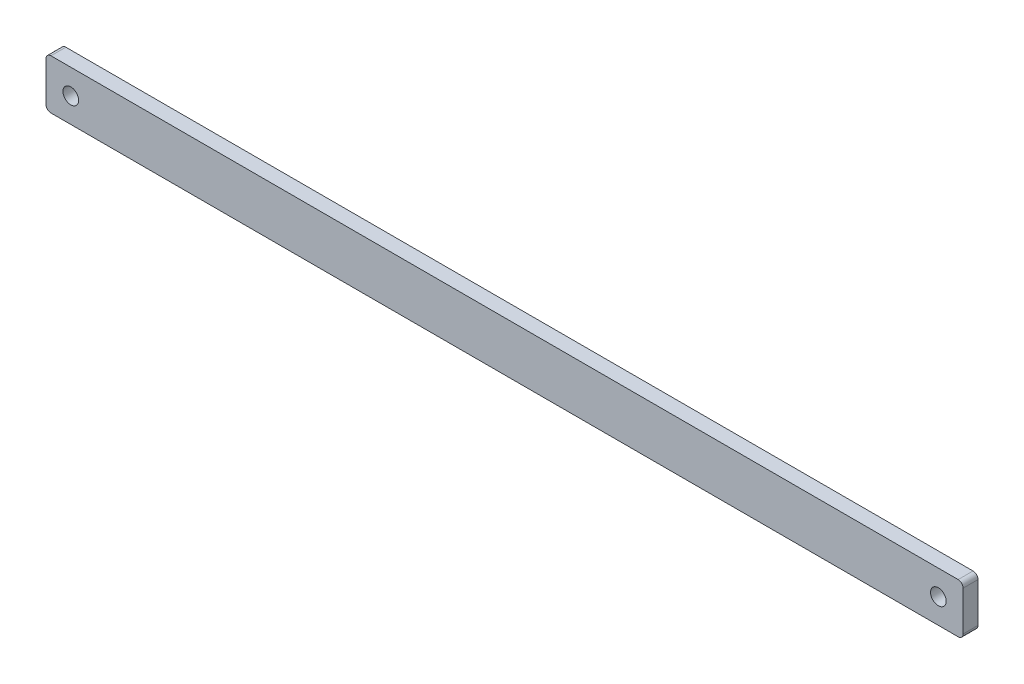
ISO-10303-21;
HEADER;
FILE_DESCRIPTION(('STEP AP214'),'2;1');
FILE_NAME('part.step','',(''),(''),'','','');
FILE_SCHEMA(('AUTOMOTIVE_DESIGN { 1 0 10303 214 1 1 1 1 }'));
ENDSEC;
DATA;
#1=APPLICATION_CONTEXT('core data for automotive mechanical design processes');
#2=APPLICATION_PROTOCOL_DEFINITION('international standard','automotive_design',2000,#1);
#3=PRODUCT_CONTEXT('',#1,'mechanical');
#4=PRODUCT('Part','Part','',(#3));
#5=PRODUCT_RELATED_PRODUCT_CATEGORY('part','',(#4));
#6=PRODUCT_DEFINITION_FORMATION('','',#4);
#7=PRODUCT_DEFINITION_CONTEXT('part definition',#1,'design');
#8=PRODUCT_DEFINITION('design','',#6,#7);
#9=PRODUCT_DEFINITION_SHAPE('','',#8);
#10=(LENGTH_UNIT() NAMED_UNIT(*) SI_UNIT(.MILLI.,.METRE.));
#11=(NAMED_UNIT(*) PLANE_ANGLE_UNIT() SI_UNIT($,.RADIAN.));
#12=(NAMED_UNIT(*) SI_UNIT($,.STERADIAN.) SOLID_ANGLE_UNIT());
#13=UNCERTAINTY_MEASURE_WITH_UNIT(LENGTH_MEASURE(1.E-05),#10,'distance_accuracy_value','');
#14=(GEOMETRIC_REPRESENTATION_CONTEXT(3) GLOBAL_UNCERTAINTY_ASSIGNED_CONTEXT((#13)) GLOBAL_UNIT_ASSIGNED_CONTEXT((#10,
#11,#12)) REPRESENTATION_CONTEXT('',''));
#15=CARTESIAN_POINT('',(0.,0.,0.));
#16=DIRECTION('',(0.,0.,1.));
#17=DIRECTION('',(1.,0.,0.));
#18=AXIS2_PLACEMENT_3D('',#15,#16,#17);
#19=CARTESIAN_POINT('',(0.,0.,7.62));
#20=DIRECTION('',(1.,0.,0.));
#21=DIRECTION('',(0.,0.,-1.));
#22=AXIS2_PLACEMENT_3D('',#19,#20,#21);
#23=PLANE('',#22);
#24=DIRECTION('',(0.,-1.,0.));
#25=VECTOR('',#24,1.);
#26=CARTESIAN_POINT('',(0.,0.,7.62));
#27=LINE('',#26,#25);
#28=CARTESIAN_POINT('',(0.,22.86,7.62));
#29=VERTEX_POINT('',#28);
#30=CARTESIAN_POINT('',(0.,2.54,7.62));
#31=VERTEX_POINT('',#30);
#32=EDGE_CURVE('E130',#29,#31,#27,.T.);
#33=ORIENTED_EDGE('',*,*,#32,.F.);
#34=DIRECTION('',(0.,0.,-1.));
#35=VECTOR('',#34,1.);
#36=CARTESIAN_POINT('',(0.,22.86,7.62));
#37=LINE('',#36,#35);
#38=CARTESIAN_POINT('',(0.,22.86,0.));
#39=VERTEX_POINT('',#38);
#40=EDGE_CURVE('E114',#29,#39,#37,.T.);
#41=ORIENTED_EDGE('',*,*,#40,.T.);
#42=DIRECTION('',(0.,-1.,0.));
#43=VECTOR('',#42,1.);
#44=CARTESIAN_POINT('',(0.,0.,0.));
#45=LINE('',#44,#43);
#46=CARTESIAN_POINT('',(0.,2.54,0.));
#47=VERTEX_POINT('',#46);
#48=EDGE_CURVE('E127',#39,#47,#45,.T.);
#49=ORIENTED_EDGE('',*,*,#48,.T.);
#50=DIRECTION('',(0.,0.,-1.));
#51=VECTOR('',#50,1.);
#52=CARTESIAN_POINT('',(0.,2.54,7.62));
#53=LINE('',#52,#51);
#54=EDGE_CURVE('E133',#47,#31,#53,.F.);
#55=ORIENTED_EDGE('',*,*,#54,.T.);
#56=EDGE_LOOP('',(#33,#41,#49,#55));
#57=FACE_BOUND('',#56,.T.);
#58=ADVANCED_FACE('F43',(#57),#23,.F.);
#59=CARTESIAN_POINT('',(0.,0.,7.62));
#60=DIRECTION('',(0.,1.,0.));
#61=DIRECTION('',(0.,0.,1.));
#62=AXIS2_PLACEMENT_3D('',#59,#60,#61);
#63=PLANE('',#62);
#64=DIRECTION('',(1.,0.,0.));
#65=VECTOR('',#64,1.);
#66=CARTESIAN_POINT('',(0.,0.,7.62));
#67=LINE('',#66,#65);
#68=CARTESIAN_POINT('',(2.54,0.,7.62));
#69=VERTEX_POINT('',#68);
#70=CARTESIAN_POINT('',(467.36,0.,7.62));
#71=VERTEX_POINT('',#70);
#72=EDGE_CURVE('E195',#69,#71,#67,.T.);
#73=ORIENTED_EDGE('',*,*,#72,.F.);
#74=DIRECTION('',(0.,0.,-1.));
#75=VECTOR('',#74,1.);
#76=CARTESIAN_POINT('',(2.54,0.,7.62));
#77=LINE('',#76,#75);
#78=CARTESIAN_POINT('',(2.54,0.,0.));
#79=VERTEX_POINT('',#78);
#80=EDGE_CURVE('E186',#69,#79,#77,.T.);
#81=ORIENTED_EDGE('',*,*,#80,.T.);
#82=DIRECTION('',(1.,0.,0.));
#83=VECTOR('',#82,1.);
#84=CARTESIAN_POINT('',(0.,0.,0.));
#85=LINE('',#84,#83);
#86=CARTESIAN_POINT('',(467.36,0.,0.));
#87=VERTEX_POINT('',#86);
#88=EDGE_CURVE('E138',#79,#87,#85,.T.);
#89=ORIENTED_EDGE('',*,*,#88,.T.);
#90=DIRECTION('',(0.,0.,-1.));
#91=VECTOR('',#90,1.);
#92=CARTESIAN_POINT('',(467.36,0.,7.62));
#93=LINE('',#92,#91);
#94=EDGE_CURVE('E183',#87,#71,#93,.F.);
#95=ORIENTED_EDGE('',*,*,#94,.T.);
#96=EDGE_LOOP('',(#73,#81,#89,#95));
#97=FACE_BOUND('',#96,.T.);
#98=ADVANCED_FACE('F245',(#97),#63,.F.);
#99=CARTESIAN_POINT('',(469.9,0.,7.62));
#100=DIRECTION('',(-1.,0.,0.));
#101=DIRECTION('',(0.,0.,1.));
#102=AXIS2_PLACEMENT_3D('',#99,#100,#101);
#103=PLANE('',#102);
#104=DIRECTION('',(0.,1.,0.));
#105=VECTOR('',#104,1.);
#106=CARTESIAN_POINT('',(469.9,0.,7.62));
#107=LINE('',#106,#105);
#108=CARTESIAN_POINT('',(469.9,2.54,7.62));
#109=VERTEX_POINT('',#108);
#110=CARTESIAN_POINT('',(469.9,22.86,7.62));
#111=VERTEX_POINT('',#110);
#112=EDGE_CURVE('E193',#109,#111,#107,.T.);
#113=ORIENTED_EDGE('',*,*,#112,.F.);
#114=DIRECTION('',(0.,0.,-1.));
#115=VECTOR('',#114,1.);
#116=CARTESIAN_POINT('',(469.9,2.54,7.62));
#117=LINE('',#116,#115);
#118=CARTESIAN_POINT('',(469.9,2.54,0.));
#119=VERTEX_POINT('',#118);
#120=EDGE_CURVE('E11',#109,#119,#117,.T.);
#121=ORIENTED_EDGE('',*,*,#120,.T.);
#122=DIRECTION('',(0.,1.,0.));
#123=VECTOR('',#122,1.);
#124=CARTESIAN_POINT('',(469.9,0.,0.));
#125=LINE('',#124,#123);
#126=CARTESIAN_POINT('',(469.9,22.86,0.));
#127=VERTEX_POINT('',#126);
#128=EDGE_CURVE('E144',#119,#127,#125,.T.);
#129=ORIENTED_EDGE('',*,*,#128,.T.);
#130=DIRECTION('',(0.,0.,-1.));
#131=VECTOR('',#130,1.);
#132=CARTESIAN_POINT('',(469.9,22.86,7.62));
#133=LINE('',#132,#131);
#134=EDGE_CURVE('E52',#127,#111,#133,.F.);
#135=ORIENTED_EDGE('',*,*,#134,.T.);
#136=EDGE_LOOP('',(#113,#121,#129,#135));
#137=FACE_BOUND('',#136,.T.);
#138=ADVANCED_FACE('F238',(#137),#103,.F.);
#139=CARTESIAN_POINT('',(0.,25.4,7.62));
#140=DIRECTION('',(0.,-1.,0.));
#141=DIRECTION('',(0.,0.,-1.));
#142=AXIS2_PLACEMENT_3D('',#139,#140,#141);
#143=PLANE('',#142);
#144=DIRECTION('',(-1.,0.,0.));
#145=VECTOR('',#144,1.);
#146=CARTESIAN_POINT('',(0.,25.4,0.));
#147=LINE('',#146,#145);
#148=CARTESIAN_POINT('',(467.36,25.4,0.));
#149=VERTEX_POINT('',#148);
#150=CARTESIAN_POINT('',(2.54,25.4,0.));
#151=VERTEX_POINT('',#150);
#152=EDGE_CURVE('E155',#149,#151,#147,.T.);
#153=ORIENTED_EDGE('',*,*,#152,.T.);
#154=DIRECTION('',(0.,0.,-1.));
#155=VECTOR('',#154,1.);
#156=CARTESIAN_POINT('',(2.54,25.4,7.62));
#157=LINE('',#156,#155);
#158=CARTESIAN_POINT('',(2.54,25.4,7.62));
#159=VERTEX_POINT('',#158);
#160=EDGE_CURVE('E115',#151,#159,#157,.F.);
#161=ORIENTED_EDGE('',*,*,#160,.T.);
#162=DIRECTION('',(-1.,0.,0.));
#163=VECTOR('',#162,1.);
#164=CARTESIAN_POINT('',(0.,25.4,7.62));
#165=LINE('',#164,#163);
#166=CARTESIAN_POINT('',(467.36,25.4,7.62));
#167=VERTEX_POINT('',#166);
#168=EDGE_CURVE('E150',#167,#159,#165,.T.);
#169=ORIENTED_EDGE('',*,*,#168,.F.);
#170=DIRECTION('',(0.,0.,-1.));
#171=VECTOR('',#170,1.);
#172=CARTESIAN_POINT('',(467.36,25.4,7.62));
#173=LINE('',#172,#171);
#174=EDGE_CURVE('E121',#167,#149,#173,.T.);
#175=ORIENTED_EDGE('',*,*,#174,.T.);
#176=EDGE_LOOP('',(#153,#161,#169,#175));
#177=FACE_BOUND('',#176,.T.);
#178=ADVANCED_FACE('F229',(#177),#143,.F.);
#179=CARTESIAN_POINT('',(0.,0.,7.62));
#180=DIRECTION('',(0.,0.,-1.));
#181=DIRECTION('',(-1.,0.,0.));
#182=AXIS2_PLACEMENT_3D('',#179,#180,#181);
#183=PLANE('',#182);
#184=CARTESIAN_POINT('',(457.2,12.6999999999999,7.62));
#185=DIRECTION('',(0.,0.,-1.));
#186=DIRECTION('',(-1.,0.,0.));
#187=AXIS2_PLACEMENT_3D('',#184,#185,#186);
#188=CIRCLE('',#187,4.);
#189=CARTESIAN_POINT('',(461.2,12.6999999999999,7.62));
#190=VERTEX_POINT('',#189);
#191=EDGE_CURVE('E205',#190,#190,#188,.T.);
#192=ORIENTED_EDGE('',*,*,#191,.T.);
#193=EDGE_LOOP('',(#192));
#194=FACE_BOUND('',#193,.T.);
#195=CARTESIAN_POINT('',(12.7,12.6999999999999,7.62));
#196=DIRECTION('',(0.,0.,1.));
#197=DIRECTION('',(1.,0.,0.));
#198=AXIS2_PLACEMENT_3D('',#195,#196,#197);
#199=CIRCLE('',#198,4.);
#200=CARTESIAN_POINT('',(16.7,12.6999999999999,7.62));
#201=VERTEX_POINT('',#200);
#202=EDGE_CURVE('E147',#201,#201,#199,.T.);
#203=ORIENTED_EDGE('',*,*,#202,.F.);
#204=EDGE_LOOP('',(#203));
#205=FACE_BOUND('',#204,.T.);
#206=ORIENTED_EDGE('',*,*,#168,.T.);
#207=CARTESIAN_POINT('',(2.54,22.86,7.62));
#208=DIRECTION('',(0.,0.,-1.));
#209=DIRECTION('',(-1.,0.,0.));
#210=AXIS2_PLACEMENT_3D('',#207,#208,#209);
#211=CIRCLE('',#210,2.54);
#212=EDGE_CURVE('E180',#159,#29,#211,.F.);
#213=ORIENTED_EDGE('',*,*,#212,.T.);
#214=ORIENTED_EDGE('',*,*,#32,.T.);
#215=CARTESIAN_POINT('',(2.54,2.54,7.62));
#216=DIRECTION('',(0.,0.,-1.));
#217=DIRECTION('',(-1.,0.,0.));
#218=AXIS2_PLACEMENT_3D('',#215,#216,#217);
#219=CIRCLE('',#218,2.54);
#220=EDGE_CURVE('E177',#31,#69,#219,.F.);
#221=ORIENTED_EDGE('',*,*,#220,.T.);
#222=ORIENTED_EDGE('',*,*,#72,.T.);
#223=CARTESIAN_POINT('',(467.36,2.54,7.62));
#224=DIRECTION('',(0.,0.,-1.));
#225=DIRECTION('',(-1.,0.,0.));
#226=AXIS2_PLACEMENT_3D('',#223,#224,#225);
#227=CIRCLE('',#226,2.54);
#228=EDGE_CURVE('E65',#71,#109,#227,.F.);
#229=ORIENTED_EDGE('',*,*,#228,.T.);
#230=ORIENTED_EDGE('',*,*,#112,.T.);
#231=CARTESIAN_POINT('',(467.36,22.86,7.62));
#232=DIRECTION('',(0.,0.,-1.));
#233=DIRECTION('',(-1.,0.,0.));
#234=AXIS2_PLACEMENT_3D('',#231,#232,#233);
#235=CIRCLE('',#234,2.54);
#236=EDGE_CURVE('E172',#111,#167,#235,.F.);
#237=ORIENTED_EDGE('',*,*,#236,.T.);
#238=EDGE_LOOP('',(#206,#213,#214,#221,#222,#229,#230,#237));
#239=FACE_BOUND('',#238,.T.);
#240=ADVANCED_FACE('F219',(#194,#205,#239),#183,.F.);
#241=CARTESIAN_POINT('',(0.,0.,0.));
#242=DIRECTION('',(0.,0.,-1.));
#243=DIRECTION('',(-1.,0.,0.));
#244=AXIS2_PLACEMENT_3D('',#241,#242,#243);
#245=PLANE('',#244);
#246=CARTESIAN_POINT('',(457.2,12.6999999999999,0.));
#247=DIRECTION('',(0.,0.,-1.));
#248=DIRECTION('',(-1.,0.,0.));
#249=AXIS2_PLACEMENT_3D('',#246,#247,#248);
#250=CIRCLE('',#249,4.);
#251=CARTESIAN_POINT('',(461.2,12.6999999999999,0.));
#252=VERTEX_POINT('',#251);
#253=EDGE_CURVE('E203',#252,#252,#250,.T.);
#254=ORIENTED_EDGE('',*,*,#253,.F.);
#255=EDGE_LOOP('',(#254));
#256=FACE_BOUND('',#255,.T.);
#257=CARTESIAN_POINT('',(12.7,12.6999999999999,0.));
#258=DIRECTION('',(0.,0.,1.));
#259=DIRECTION('',(1.,0.,0.));
#260=AXIS2_PLACEMENT_3D('',#257,#258,#259);
#261=CIRCLE('',#260,4.);
#262=CARTESIAN_POINT('',(16.7,12.6999999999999,0.));
#263=VERTEX_POINT('',#262);
#264=EDGE_CURVE('E139',#263,#263,#261,.T.);
#265=ORIENTED_EDGE('',*,*,#264,.T.);
#266=EDGE_LOOP('',(#265));
#267=FACE_BOUND('',#266,.T.);
#268=ORIENTED_EDGE('',*,*,#48,.F.);
#269=CARTESIAN_POINT('',(2.54,22.86,0.));
#270=DIRECTION('',(0.,0.,-1.));
#271=DIRECTION('',(-1.,0.,0.));
#272=AXIS2_PLACEMENT_3D('',#269,#270,#271);
#273=CIRCLE('',#272,2.54);
#274=EDGE_CURVE('E110',#39,#151,#273,.T.);
#275=ORIENTED_EDGE('',*,*,#274,.T.);
#276=ORIENTED_EDGE('',*,*,#152,.F.);
#277=CARTESIAN_POINT('',(467.36,22.86,0.));
#278=DIRECTION('',(0.,0.,-1.));
#279=DIRECTION('',(-1.,0.,0.));
#280=AXIS2_PLACEMENT_3D('',#277,#278,#279);
#281=CIRCLE('',#280,2.54);
#282=EDGE_CURVE('E132',#149,#127,#281,.T.);
#283=ORIENTED_EDGE('',*,*,#282,.T.);
#284=ORIENTED_EDGE('',*,*,#128,.F.);
#285=CARTESIAN_POINT('',(467.36,2.54,0.));
#286=DIRECTION('',(0.,0.,-1.));
#287=DIRECTION('',(-1.,0.,0.));
#288=AXIS2_PLACEMENT_3D('',#285,#286,#287);
#289=CIRCLE('',#288,2.54);
#290=EDGE_CURVE('E162',#119,#87,#289,.T.);
#291=ORIENTED_EDGE('',*,*,#290,.T.);
#292=ORIENTED_EDGE('',*,*,#88,.F.);
#293=CARTESIAN_POINT('',(2.54,2.54,0.));
#294=DIRECTION('',(0.,0.,-1.));
#295=DIRECTION('',(-1.,0.,0.));
#296=AXIS2_PLACEMENT_3D('',#293,#294,#295);
#297=CIRCLE('',#296,2.54);
#298=EDGE_CURVE('E122',#79,#47,#297,.T.);
#299=ORIENTED_EDGE('',*,*,#298,.T.);
#300=EDGE_LOOP('',(#268,#275,#276,#283,#284,#291,#292,#299));
#301=FACE_BOUND('',#300,.T.);
#302=ADVANCED_FACE('F135',(#256,#267,#301),#245,.T.);
#303=CARTESIAN_POINT('',(12.7,12.6999999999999,0.));
#304=DIRECTION('',(0.,0.,1.));
#305=DIRECTION('',(1.,0.,0.));
#306=AXIS2_PLACEMENT_3D('',#303,#304,#305);
#307=CYLINDRICAL_SURFACE('',#306,4.);
#308=CARTESIAN_POINT('',(16.7,12.6999999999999,0.));
#309=CARTESIAN_POINT('',(16.7,12.6999999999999,0.0793749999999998));
#310=CARTESIAN_POINT('',(16.7,12.6999999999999,0.15875));
#311=CARTESIAN_POINT('',(16.7,12.6999999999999,0.3175));
#312=CARTESIAN_POINT('',(16.7,12.6999999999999,0.396875));
#313=CARTESIAN_POINT('',(16.7,12.6999999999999,0.555625));
#314=CARTESIAN_POINT('',(16.7,12.6999999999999,0.635));
#315=CARTESIAN_POINT('',(16.7,12.6999999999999,0.79375));
#316=CARTESIAN_POINT('',(16.7,12.6999999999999,0.873125));
#317=CARTESIAN_POINT('',(16.7,12.6999999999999,1.031875));
#318=CARTESIAN_POINT('',(16.7,12.6999999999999,1.11125));
#319=CARTESIAN_POINT('',(16.7,12.6999999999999,1.27));
#320=CARTESIAN_POINT('',(16.7,12.6999999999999,1.349375));
#321=CARTESIAN_POINT('',(16.7,12.6999999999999,1.508125));
#322=CARTESIAN_POINT('',(16.7,12.6999999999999,1.5875));
#323=CARTESIAN_POINT('',(16.7,12.6999999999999,1.74625));
#324=CARTESIAN_POINT('',(16.7,12.6999999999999,1.825625));
#325=CARTESIAN_POINT('',(16.7,12.6999999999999,1.984375));
#326=CARTESIAN_POINT('',(16.7,12.6999999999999,2.06375));
#327=CARTESIAN_POINT('',(16.7,12.6999999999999,2.2225));
#328=CARTESIAN_POINT('',(16.7,12.6999999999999,2.301875));
#329=CARTESIAN_POINT('',(16.7,12.6999999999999,2.460625));
#330=CARTESIAN_POINT('',(16.7,12.6999999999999,2.54));
#331=CARTESIAN_POINT('',(16.7,12.6999999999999,2.69875));
#332=CARTESIAN_POINT('',(16.7,12.6999999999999,2.778125));
#333=CARTESIAN_POINT('',(16.7,12.6999999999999,2.936875));
#334=CARTESIAN_POINT('',(16.7,12.6999999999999,3.01625));
#335=CARTESIAN_POINT('',(16.7,12.6999999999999,3.175));
#336=CARTESIAN_POINT('',(16.7,12.6999999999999,3.254375));
#337=CARTESIAN_POINT('',(16.7,12.6999999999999,3.413125));
#338=CARTESIAN_POINT('',(16.7,12.6999999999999,3.4925));
#339=CARTESIAN_POINT('',(16.7,12.6999999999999,3.65125));
#340=CARTESIAN_POINT('',(16.7,12.6999999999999,3.730625));
#341=CARTESIAN_POINT('',(16.7,12.6999999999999,3.889375));
#342=CARTESIAN_POINT('',(16.7,12.6999999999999,3.96875));
#343=CARTESIAN_POINT('',(16.7,12.6999999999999,4.1275));
#344=CARTESIAN_POINT('',(16.7,12.6999999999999,4.206875));
#345=CARTESIAN_POINT('',(16.7,12.6999999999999,4.365625));
#346=CARTESIAN_POINT('',(16.7,12.6999999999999,4.445));
#347=CARTESIAN_POINT('',(16.7,12.6999999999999,4.60375));
#348=CARTESIAN_POINT('',(16.7,12.6999999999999,4.683125));
#349=CARTESIAN_POINT('',(16.7,12.6999999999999,4.841875));
#350=CARTESIAN_POINT('',(16.7,12.6999999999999,4.92125));
#351=CARTESIAN_POINT('',(16.7,12.6999999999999,5.08));
#352=CARTESIAN_POINT('',(16.7,12.6999999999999,5.159375));
#353=CARTESIAN_POINT('',(16.7,12.6999999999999,5.318125));
#354=CARTESIAN_POINT('',(16.7,12.6999999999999,5.3975));
#355=CARTESIAN_POINT('',(16.7,12.6999999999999,5.55625));
#356=CARTESIAN_POINT('',(16.7,12.6999999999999,5.635625));
#357=CARTESIAN_POINT('',(16.7,12.6999999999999,5.794375));
#358=CARTESIAN_POINT('',(16.7,12.6999999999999,5.87375));
#359=CARTESIAN_POINT('',(16.7,12.6999999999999,6.0325));
#360=CARTESIAN_POINT('',(16.7,12.6999999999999,6.111875));
#361=CARTESIAN_POINT('',(16.7,12.6999999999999,6.270625));
#362=CARTESIAN_POINT('',(16.7,12.6999999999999,6.35));
#363=CARTESIAN_POINT('',(16.7,12.6999999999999,6.50875));
#364=CARTESIAN_POINT('',(16.7,12.6999999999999,6.588125));
#365=CARTESIAN_POINT('',(16.7,12.6999999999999,6.746875));
#366=CARTESIAN_POINT('',(16.7,12.6999999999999,6.82625));
#367=CARTESIAN_POINT('',(16.7,12.6999999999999,6.985));
#368=CARTESIAN_POINT('',(16.7,12.6999999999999,7.064375));
#369=CARTESIAN_POINT('',(16.7,12.6999999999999,7.223125));
#370=CARTESIAN_POINT('',(16.7,12.6999999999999,7.3025));
#371=CARTESIAN_POINT('',(16.7,12.6999999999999,7.46125));
#372=CARTESIAN_POINT('',(16.7,12.6999999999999,7.540625));
#373=CARTESIAN_POINT('',(16.7,12.6999999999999,7.62));
#374=B_SPLINE_CURVE_WITH_KNOTS('',3,(#308,#309,#310,#311,#312,#313,#314,#315,#316,#317,#318,
#319,#320,#321,#322,#323,#324,#325,#326,#327,#328,#329,#330,#331,#332,#333,#334,#335,#336,#337,
#338,#339,#340,#341,#342,#343,#344,#345,#346,#347,#348,#349,#350,#351,#352,#353,#354,#355,#356,
#357,#358,#359,#360,#361,#362,#363,#364,#365,#366,#367,#368,#369,#370,#371,#372,#373),
.UNSPECIFIED.,.F.,.F.,(4,2,2,2,2,2,2,2,2,2,2,2,2,2,2,2,2,2,2,2,2,2,2,2,2,2,2,2,2,2,2,2,4),(0.,
0.238125,0.47625,0.714375,0.9525,1.190625,1.42875,1.666875,1.905,2.143125,2.38125,2.619375,
2.8575,3.095625,3.33375,3.571875,3.81,4.048125,4.28625,4.524375,4.7625,5.000625,5.23875,
5.476875,5.715,5.953125,6.19125,6.429375,6.6675,6.905625,7.14375,7.381875,7.62),.UNSPECIFIED.);
#375=EDGE_CURVE('BSEAM218',#263,#201,#374,.T.);
#376=ORIENTED_EDGE('',*,*,#264,.F.);
#377=ORIENTED_EDGE('',*,*,#202,.T.);
#378=ORIENTED_EDGE('',*,*,#375,.T.);
#379=ORIENTED_EDGE('',*,*,#375,.F.);
#380=EDGE_LOOP('',(#376,#378,#377,#379));
#381=FACE_BOUND('',#380,.T.);
#382=ADVANCED_FACE('F218',(#381),#307,.F.);
#383=CARTESIAN_POINT('',(457.2,12.6999999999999,0.));
#384=DIRECTION('',(0.,0.,1.));
#385=DIRECTION('',(1.,0.,0.));
#386=AXIS2_PLACEMENT_3D('',#383,#384,#385);
#387=CYLINDRICAL_SURFACE('',#386,4.);
#388=CARTESIAN_POINT('',(461.2,12.6999999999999,0.));
#389=CARTESIAN_POINT('',(461.2,12.6999999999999,0.0793749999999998));
#390=CARTESIAN_POINT('',(461.2,12.6999999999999,0.15875));
#391=CARTESIAN_POINT('',(461.2,12.6999999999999,0.3175));
#392=CARTESIAN_POINT('',(461.2,12.6999999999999,0.396875));
#393=CARTESIAN_POINT('',(461.2,12.6999999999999,0.555625));
#394=CARTESIAN_POINT('',(461.2,12.6999999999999,0.635));
#395=CARTESIAN_POINT('',(461.2,12.6999999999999,0.79375));
#396=CARTESIAN_POINT('',(461.2,12.6999999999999,0.873125));
#397=CARTESIAN_POINT('',(461.2,12.6999999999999,1.031875));
#398=CARTESIAN_POINT('',(461.2,12.6999999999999,1.11125));
#399=CARTESIAN_POINT('',(461.2,12.6999999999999,1.27));
#400=CARTESIAN_POINT('',(461.2,12.6999999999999,1.349375));
#401=CARTESIAN_POINT('',(461.2,12.6999999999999,1.508125));
#402=CARTESIAN_POINT('',(461.2,12.6999999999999,1.5875));
#403=CARTESIAN_POINT('',(461.2,12.6999999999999,1.74625));
#404=CARTESIAN_POINT('',(461.2,12.6999999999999,1.825625));
#405=CARTESIAN_POINT('',(461.2,12.6999999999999,1.984375));
#406=CARTESIAN_POINT('',(461.2,12.6999999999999,2.06375));
#407=CARTESIAN_POINT('',(461.2,12.6999999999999,2.2225));
#408=CARTESIAN_POINT('',(461.2,12.6999999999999,2.301875));
#409=CARTESIAN_POINT('',(461.2,12.6999999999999,2.460625));
#410=CARTESIAN_POINT('',(461.2,12.6999999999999,2.54));
#411=CARTESIAN_POINT('',(461.2,12.6999999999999,2.69875));
#412=CARTESIAN_POINT('',(461.2,12.6999999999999,2.778125));
#413=CARTESIAN_POINT('',(461.2,12.6999999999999,2.936875));
#414=CARTESIAN_POINT('',(461.2,12.6999999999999,3.01625));
#415=CARTESIAN_POINT('',(461.2,12.6999999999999,3.175));
#416=CARTESIAN_POINT('',(461.2,12.6999999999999,3.254375));
#417=CARTESIAN_POINT('',(461.2,12.6999999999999,3.413125));
#418=CARTESIAN_POINT('',(461.2,12.6999999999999,3.4925));
#419=CARTESIAN_POINT('',(461.2,12.6999999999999,3.65125));
#420=CARTESIAN_POINT('',(461.2,12.6999999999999,3.730625));
#421=CARTESIAN_POINT('',(461.2,12.6999999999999,3.889375));
#422=CARTESIAN_POINT('',(461.2,12.6999999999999,3.96875));
#423=CARTESIAN_POINT('',(461.2,12.6999999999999,4.1275));
#424=CARTESIAN_POINT('',(461.2,12.6999999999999,4.206875));
#425=CARTESIAN_POINT('',(461.2,12.6999999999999,4.365625));
#426=CARTESIAN_POINT('',(461.2,12.6999999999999,4.445));
#427=CARTESIAN_POINT('',(461.2,12.6999999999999,4.60375));
#428=CARTESIAN_POINT('',(461.2,12.6999999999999,4.683125));
#429=CARTESIAN_POINT('',(461.2,12.6999999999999,4.841875));
#430=CARTESIAN_POINT('',(461.2,12.6999999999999,4.92125));
#431=CARTESIAN_POINT('',(461.2,12.6999999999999,5.08));
#432=CARTESIAN_POINT('',(461.2,12.6999999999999,5.159375));
#433=CARTESIAN_POINT('',(461.2,12.6999999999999,5.318125));
#434=CARTESIAN_POINT('',(461.2,12.6999999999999,5.3975));
#435=CARTESIAN_POINT('',(461.2,12.6999999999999,5.55625));
#436=CARTESIAN_POINT('',(461.2,12.6999999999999,5.635625));
#437=CARTESIAN_POINT('',(461.2,12.6999999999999,5.794375));
#438=CARTESIAN_POINT('',(461.2,12.6999999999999,5.87375));
#439=CARTESIAN_POINT('',(461.2,12.6999999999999,6.0325));
#440=CARTESIAN_POINT('',(461.2,12.6999999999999,6.111875));
#441=CARTESIAN_POINT('',(461.2,12.6999999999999,6.270625));
#442=CARTESIAN_POINT('',(461.2,12.6999999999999,6.35));
#443=CARTESIAN_POINT('',(461.2,12.6999999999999,6.50875));
#444=CARTESIAN_POINT('',(461.2,12.6999999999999,6.588125));
#445=CARTESIAN_POINT('',(461.2,12.6999999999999,6.746875));
#446=CARTESIAN_POINT('',(461.2,12.6999999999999,6.82625));
#447=CARTESIAN_POINT('',(461.2,12.6999999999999,6.985));
#448=CARTESIAN_POINT('',(461.2,12.6999999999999,7.064375));
#449=CARTESIAN_POINT('',(461.2,12.6999999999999,7.223125));
#450=CARTESIAN_POINT('',(461.2,12.6999999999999,7.3025));
#451=CARTESIAN_POINT('',(461.2,12.6999999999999,7.46125));
#452=CARTESIAN_POINT('',(461.2,12.6999999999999,7.540625));
#453=CARTESIAN_POINT('',(461.2,12.6999999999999,7.62));
#454=B_SPLINE_CURVE_WITH_KNOTS('',3,(#388,#389,#390,#391,#392,#393,#394,#395,#396,#397,#398,
#399,#400,#401,#402,#403,#404,#405,#406,#407,#408,#409,#410,#411,#412,#413,#414,#415,#416,#417,
#418,#419,#420,#421,#422,#423,#424,#425,#426,#427,#428,#429,#430,#431,#432,#433,#434,#435,#436,
#437,#438,#439,#440,#441,#442,#443,#444,#445,#446,#447,#448,#449,#450,#451,#452,#453),
.UNSPECIFIED.,.F.,.F.,(4,2,2,2,2,2,2,2,2,2,2,2,2,2,2,2,2,2,2,2,2,2,2,2,2,2,2,2,2,2,2,2,4),(0.,
0.238125,0.47625,0.714375,0.9525,1.190625,1.42875,1.666875,1.905,2.143125,2.38125,2.619375,
2.8575,3.095625,3.33375,3.571875,3.81,4.048125,4.28625,4.524375,4.7625,5.000625,5.23875,
5.476875,5.715,5.953125,6.19125,6.429375,6.6675,6.905625,7.14375,7.381875,7.62),.UNSPECIFIED.);
#455=EDGE_CURVE('BSEAM213',#252,#190,#454,.T.);
#456=ORIENTED_EDGE('',*,*,#253,.T.);
#457=ORIENTED_EDGE('',*,*,#191,.F.);
#458=ORIENTED_EDGE('',*,*,#455,.T.);
#459=ORIENTED_EDGE('',*,*,#455,.F.);
#460=EDGE_LOOP('',(#456,#458,#457,#459));
#461=FACE_BOUND('',#460,.T.);
#462=ADVANCED_FACE('F213',(#461),#387,.F.);
#463=CARTESIAN_POINT('',(2.54,22.86,7.62));
#464=DIRECTION('',(0.,0.,-1.));
#465=DIRECTION('',(-1.,0.,0.));
#466=AXIS2_PLACEMENT_3D('',#463,#464,#465);
#467=CYLINDRICAL_SURFACE('',#466,2.54);
#468=ORIENTED_EDGE('',*,*,#212,.F.);
#469=ORIENTED_EDGE('',*,*,#160,.F.);
#470=ORIENTED_EDGE('',*,*,#274,.F.);
#471=ORIENTED_EDGE('',*,*,#40,.F.);
#472=EDGE_LOOP('',(#468,#469,#470,#471));
#473=FACE_BOUND('',#472,.T.);
#474=ADVANCED_FACE('F113',(#473),#467,.T.);
#475=CARTESIAN_POINT('',(2.54,2.54,7.62));
#476=DIRECTION('',(0.,0.,-1.));
#477=DIRECTION('',(-1.,0.,0.));
#478=AXIS2_PLACEMENT_3D('',#475,#476,#477);
#479=CYLINDRICAL_SURFACE('',#478,2.54);
#480=ORIENTED_EDGE('',*,*,#220,.F.);
#481=ORIENTED_EDGE('',*,*,#54,.F.);
#482=ORIENTED_EDGE('',*,*,#298,.F.);
#483=ORIENTED_EDGE('',*,*,#80,.F.);
#484=EDGE_LOOP('',(#480,#481,#482,#483));
#485=FACE_BOUND('',#484,.T.);
#486=ADVANCED_FACE('F248',(#485),#479,.T.);
#487=CARTESIAN_POINT('',(467.36,2.54,7.62));
#488=DIRECTION('',(0.,0.,-1.));
#489=DIRECTION('',(-1.,0.,0.));
#490=AXIS2_PLACEMENT_3D('',#487,#488,#489);
#491=CYLINDRICAL_SURFACE('',#490,2.54);
#492=ORIENTED_EDGE('',*,*,#228,.F.);
#493=ORIENTED_EDGE('',*,*,#94,.F.);
#494=ORIENTED_EDGE('',*,*,#290,.F.);
#495=ORIENTED_EDGE('',*,*,#120,.F.);
#496=EDGE_LOOP('',(#492,#493,#494,#495));
#497=FACE_BOUND('',#496,.T.);
#498=ADVANCED_FACE('F241',(#497),#491,.T.);
#499=CARTESIAN_POINT('',(467.36,22.86,7.62));
#500=DIRECTION('',(0.,0.,-1.));
#501=DIRECTION('',(-1.,0.,0.));
#502=AXIS2_PLACEMENT_3D('',#499,#500,#501);
#503=CYLINDRICAL_SURFACE('',#502,2.54);
#504=ORIENTED_EDGE('',*,*,#236,.F.);
#505=ORIENTED_EDGE('',*,*,#134,.F.);
#506=ORIENTED_EDGE('',*,*,#282,.F.);
#507=ORIENTED_EDGE('',*,*,#174,.F.);
#508=EDGE_LOOP('',(#504,#505,#506,#507));
#509=FACE_BOUND('',#508,.T.);
#510=ADVANCED_FACE('F45',(#509),#503,.T.);
#511=CLOSED_SHELL('',(#58,#98,#138,#178,#240,#302,#382,#462,#474,#486,#498,#510));
#512=MANIFOLD_SOLID_BREP('B2',#511);
#513=ADVANCED_BREP_SHAPE_REPRESENTATION('',(#18,#512),#14);
#514=SHAPE_DEFINITION_REPRESENTATION(#9,#513);
ENDSEC;
END-ISO-10303-21;
